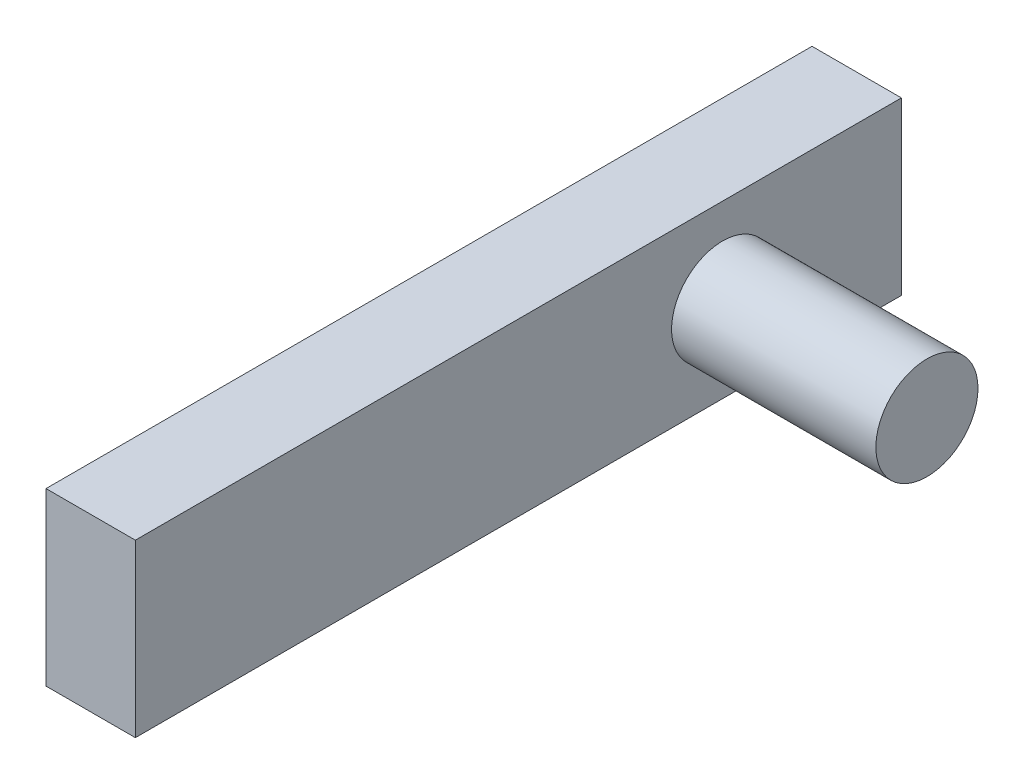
from build123d import *

# Parameters (mm, degrees)
SKETCH1_W           = 30
SKETCH1_H           = 6.7
BOSS_EXTRUDE1_DEPTH = 3.5
SKETCH2_R           = 2
BOSS_EXTRUDE2_DEPTH = 8


with BuildPart() as part:
    # Sketch1 → Boss-Extrude1 (new body)
    with BuildSketch(Plane(origin=(0, 0, 0), x_dir=(0, 0, -1), z_dir=(1, 0, 0))):
        Rectangle(SKETCH1_W, SKETCH1_H)
    extrude(amount=BOSS_EXTRUDE1_DEPTH)

    # Sketch2 → Boss-Extrude2 (add)
    with BuildSketch(Plane(origin=(3.5, 0, 0), x_dir=(0, 0, -1), z_dir=(1, 0, 0))):
        with Locations((8, 0)):
            Circle(SKETCH2_R)
    extrude(amount=BOSS_EXTRUDE2_DEPTH)


solid = part.part
